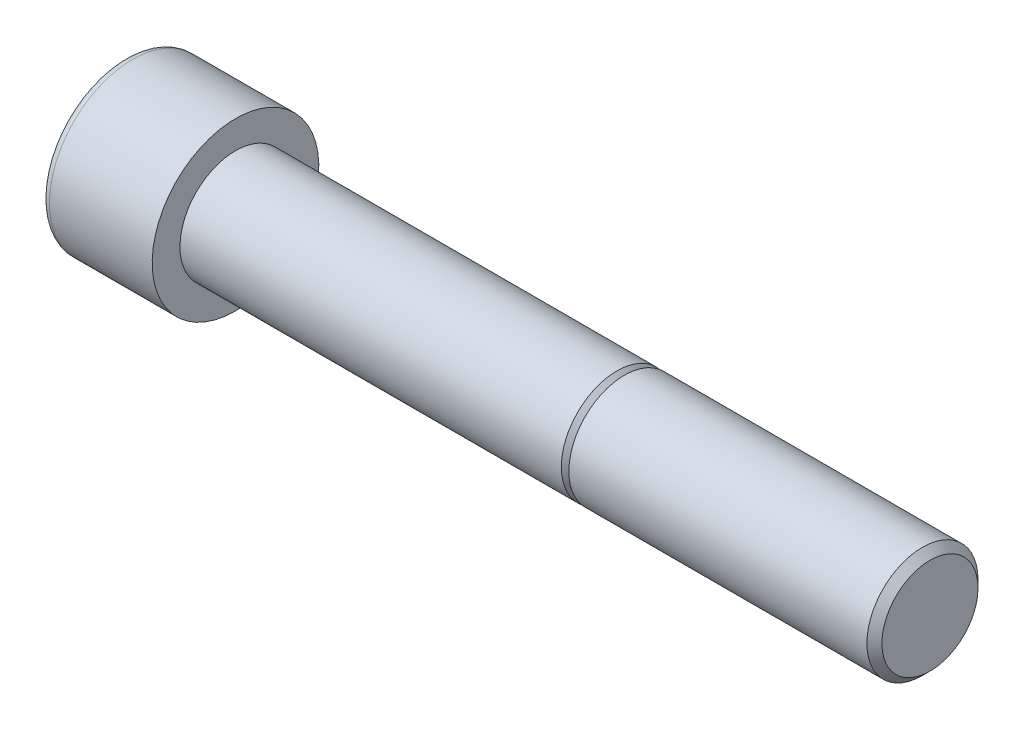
from build123d import *

# Parameters (mm, degrees)
ENL_V_MAT_EXTRU_1_DEPTH = 8
CHANFREIN1_SIZE         = 1.0825
CONG_1_R                = 1.2


with BuildPart() as part:
    # Esquisse1 → R_volution1 (revolve)
    with BuildSketch(Plane(origin=(0, 0, 0), x_dir=(-1, 0, 0), z_dir=(0, 0, -1)), mode=Mode.PRIVATE) as r_volution1_sk:
        Polygon((-80, 8), (-80, 0), (36, 0), (36, 12), (20, 12), (20, 8), (-34.9175, 8), (-36, 6.9175), (-36, 8), align=None)
    revolve(r_volution1_sk.sketch.rotate(Axis((80, 0, 0), (-1, 0, 0)), 180), axis=Axis((80, 0, 0), (-1, 0, 0)))

    # Esquisse2 → Enl_v. mat.-Extru.1 (cut)
    with BuildSketch(Plane.ZY.offset(36)):
        Polygon((-7, -4.041451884), (0, -8.082903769), (7, -4.041451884), (7, 4.041451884), (0, 8.082903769), (-7, 4.041451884), align=None)
    extrude(amount=-ENL_V_MAT_EXTRU_1_DEPTH, mode=Mode.SUBTRACT)

    # Chanfrein1
    chanfrein1_edges = [part.edges().sort_by_distance(p)[0] for p in [
        (80, 8, 0),
    ]]
    chamfer(chanfrein1_edges, length=CHANFREIN1_SIZE)

    # Cong_1
    cong_1_edges = [part.edges().sort_by_distance(p)[0] for p in [
        (-36, 12, 0),
    ]]
    fillet(cong_1_edges, radius=CONG_1_R)


solid = part.part
